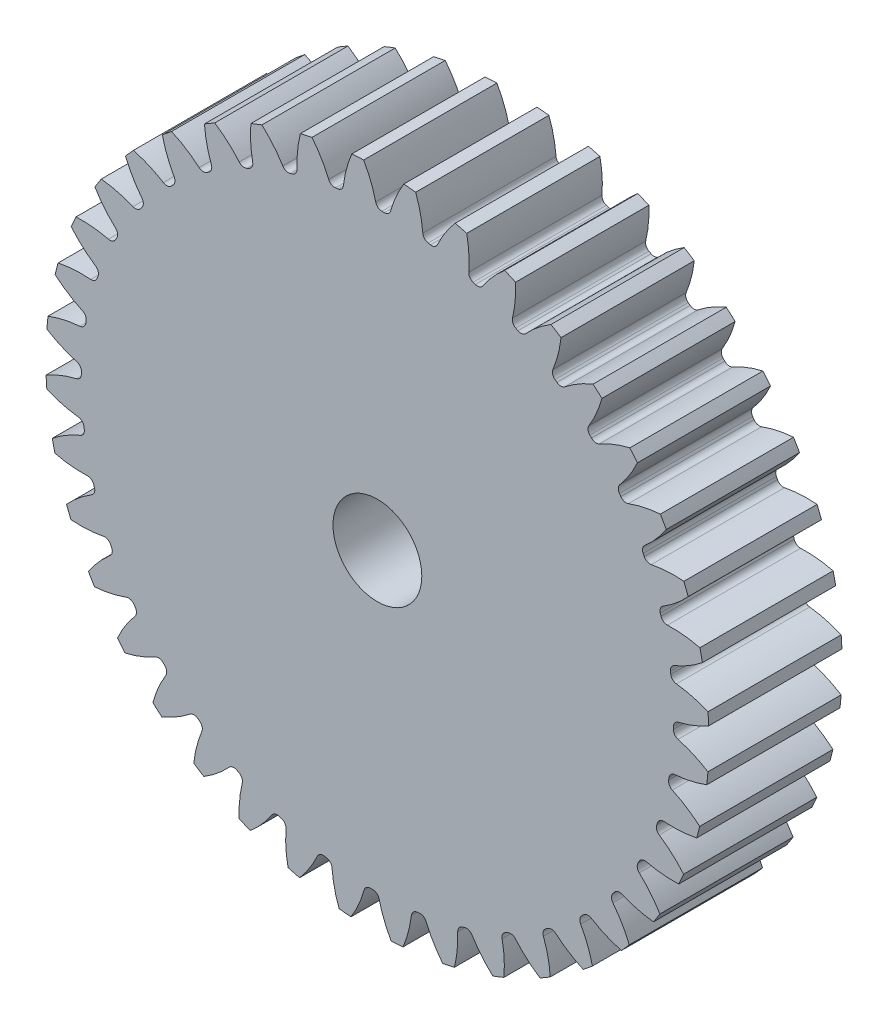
from build123d import *

# Parameters (mm, degrees)
SKETCH3_R         = 237.066666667
GEARBODY_DEPTH    = 95.25
TOOTHCUT_DEPTH    = 349.530875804
CIRPATTERN1_COUNT = 40
BOREDIA_R         = 31.75
BORE_DEPTH        = 12700


with BuildPart() as part:
    # Sketch3 → gearBody (new body)
    with BuildSketch(Plane.XY):
        Circle(SKETCH3_R)
    extrude(amount=GEARBODY_DEPTH)

    # Sketch2 → toothCut (cut, through all)
    with BuildSketch(Plane.XY):
        with BuildLine():
            ThreePointArc((211.609432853, -4.92196156), (211.627827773, -4.054662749), (211.642668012, -3.187295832))
            ThreePointArc((211.642668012, -3.187295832), (212.650834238, -0.383933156), (215.166600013, 1.211737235))
            ThreePointArc((215.166600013, 1.211737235), (226.430616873, 4.782334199), (237.066666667, 9.930312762))
            ThreePointArc((237.066666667, 9.930312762), (237.231019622, -4.545204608), (236.512306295, -19.003802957))
            ThreePointArc((236.512306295, -19.003802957), (226.081254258, -13.452191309), (214.962274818, -9.452749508))
            ThreePointArc((214.962274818, -9.452749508), (212.5094771, -7.761884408), (211.609432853, -4.92196156))
        make_face()
    toothcut = extrude(amount=TOOTHCUT_DEPTH, mode=Mode.SUBTRACT)

    # CirPattern1: toothCut ×40 about axis
    cirpattern1_axis = Axis((0, 0, 0), (0, 0, 1))
    for i in range(1, CIRPATTERN1_COUNT):
        add(toothcut.rotate(cirpattern1_axis, i * 360 / CIRPATTERN1_COUNT), mode=Mode.SUBTRACT)

    # boreDia → bore (cut, symmetric)
    with BuildSketch(Plane.XY):
        Circle(BOREDIA_R)
    extrude(amount=BORE_DEPTH, both=True, mode=Mode.SUBTRACT)


solid = part.part
